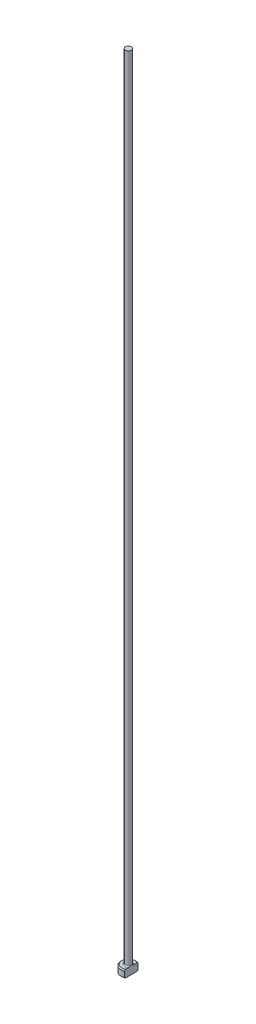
from build123d import *
from build123d.topology import SkipClean

# Parameters (mm, degrees)
CHAMFER1_SIZE = 0.2
FILLET1_R     = 0.2
KEY_DEPTH     = 161.014061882


with BuildPart() as part:
    # Sketch1 → Revolve1 (revolve)
    with BuildSketch(Plane.XY, mode=Mode.PRIVATE) as revolve1_sk:
        Polygon((0, 0), (-1.5, 0), (-1.5, 1.5), (-0.6, 1.5), (-0.6, 160), (0, 160), align=None)
    revolve(revolve1_sk.sketch.rotate(Axis((0, 259.958771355, 0), (0, -1, 0)), 270), axis=Axis((0, 259.958771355, 0), (0, -1, 0)))

    # Chamfer1
    chamfer1_edges = [part.edges().sort_by_distance(p)[0] for p in [
        (0, 1.5, -1.5),
        (0, 0, -1.5),
    ]]
    chamfer(chamfer1_edges, length=CHAMFER1_SIZE)

    # Fillet1
    fillet1_edges = [part.edges().sort_by_distance(p)[0] for p in [
        (0, 1.5, -0.6),
    ]]
    fillet(fillet1_edges, radius=FILLET1_R)

    # Sketch2 → KEY (cut, through all)
    with SkipClean():  # the faces are left unmerged after this step: merging them gives an invalid solid
        with BuildSketch(Plane(origin=(0, 0, 0), x_dir=(1, 0, 0), z_dir=(0, 1, 0))):
            with BuildLine():
                Line((0.6, 1.374772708), (0.6, -1.374772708))
                ThreePointArc((0.6, -1.374772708), (1.5, 0), (0.6, 1.374772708))
            make_face()
        extrude(amount=KEY_DEPTH, mode=Mode.SUBTRACT)


solid = part.part
